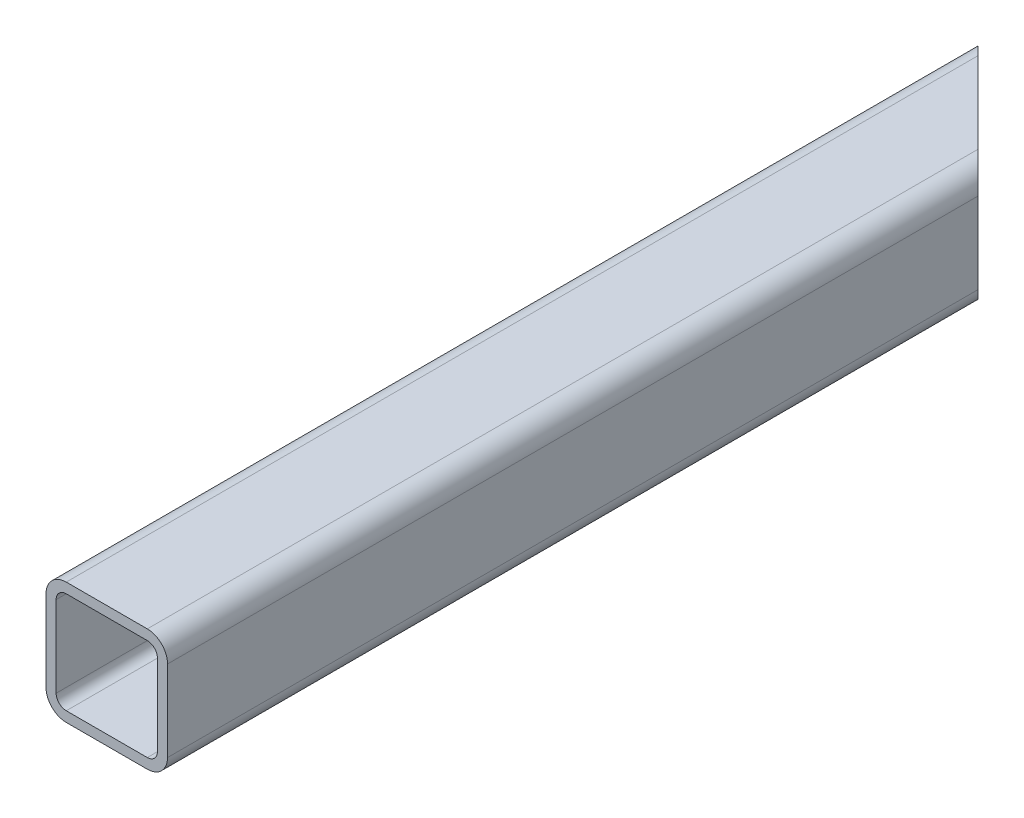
from build123d import *

# Parameters (mm, degrees)
EXTRUSION1_DEPTH = 460
EXTRUSION3_DEPTH = 465.865571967


with BuildPart() as part:
    # Sketch1 → Extrusion1 (new body)
    with BuildSketch(Plane.XY):
        with BuildLine():
            Line((-20, -30), (20, -30))
            ThreePointArc((20, -30), (27.071067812, -27.071067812), (30, -20))
            Line((30, -20), (30, 20))
            ThreePointArc((30, 20), (27.071067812, 27.071067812), (20, 30))
            Line((20, 30), (-20, 30))
            ThreePointArc((-20, 30), (-27.071067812, 27.071067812), (-30, 20))
            Line((-30, 20), (-30, -20))
            ThreePointArc((-30, -20), (-27.071067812, -27.071067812), (-20, -30))
        make_face()
        with BuildLine():
            Line((-20, -25), (20, -25))
            ThreePointArc((20, -25), (23.535533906, -23.535533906), (25, -20))
            Line((25, -20), (25, 20))
            ThreePointArc((25, 20), (23.535533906, 23.535533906), (20, 25))
            Line((20, 25), (-20, 25))
            ThreePointArc((-20, 25), (-23.535533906, 23.535533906), (-25, 20))
            Line((-25, 20), (-25, -20))
            ThreePointArc((-25, -20), (-23.535533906, -23.535533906), (-20, -25))
        make_face(mode=Mode.SUBTRACT)
    extrude(amount=EXTRUSION1_DEPTH)

    # Esquisse2 → Extrusion3 (cut, through all)
    with BuildSketch(Plane(origin=(0, 30, 0), x_dir=(1, 0, 0), z_dir=(0, 1, 0))):
        Polygon((30, -60), (-30, 0), (30, 0), align=None)
    extrude(amount=-EXTRUSION3_DEPTH, mode=Mode.SUBTRACT)


solid = part.part
